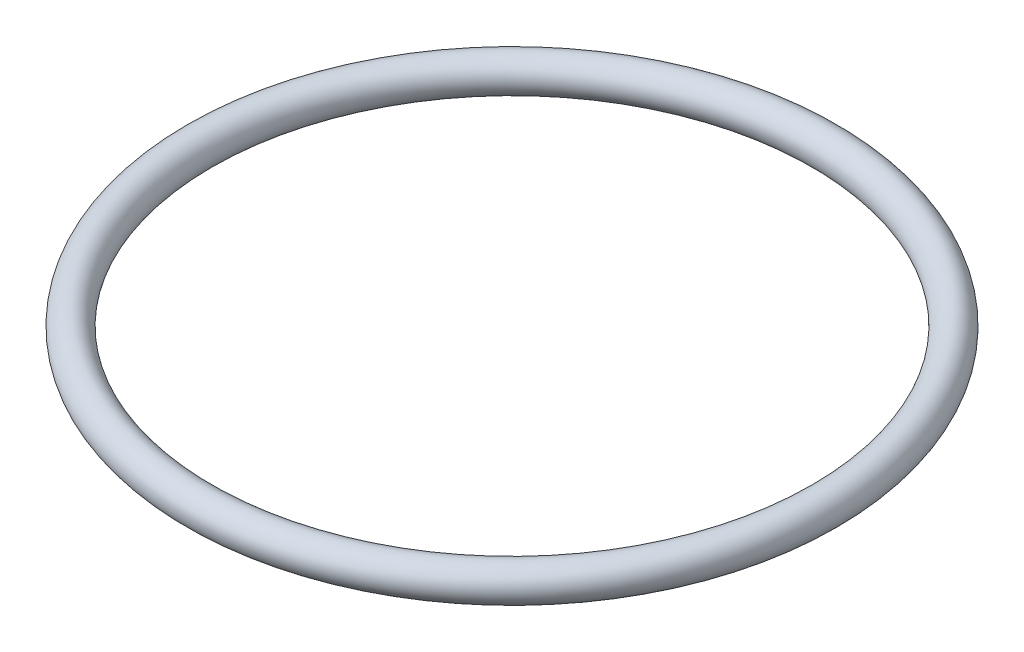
from build123d import *

# Parameters (mm, degrees)
ESQUISSE1_R = 1.765


with BuildPart() as part:
    # Esquisse1 → R_volution1 (revolve)
    with BuildSketch(Plane.XY):
        with Locations((31.725, 271.135)):
            Circle(ESQUISSE1_R)
    revolve(axis=Axis((0, 272.9, 0), (0, 1, 0)))


solid = part.part
